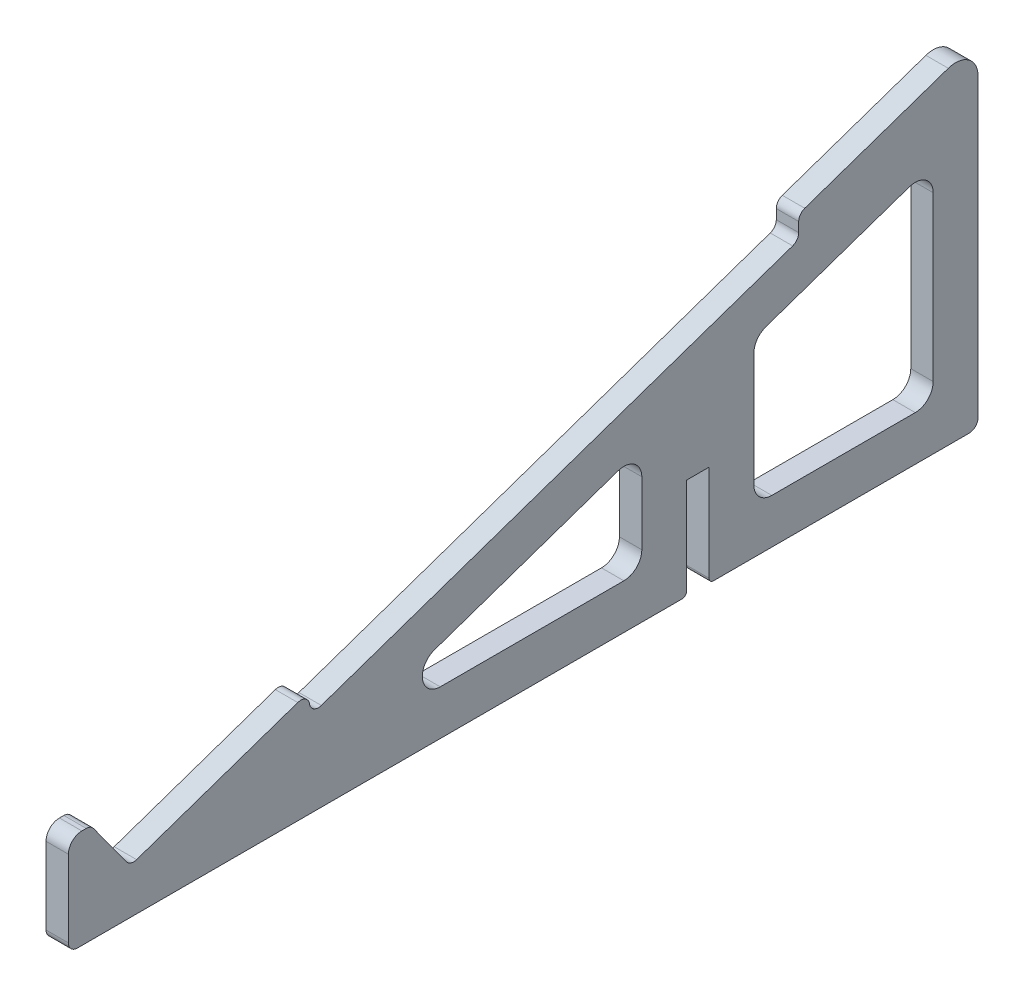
from build123d import *

# Parameters (mm, degrees)
MAIN_BODY_DEPTH  = 6.35
LIP_CUT_DEPTH    = 161.44900373
FILLET1_R        = 2.54
FILLET2_R        = 2.54
FILLET3_R        = 3.81
FILLET4_R        = 6.35
SKETCH3_W        = 6.35
SKETCH3_H        = 28.516547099
NOTCH_CUT_DEPTH  = 159.944751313
WEIGHT_CUT_DEPTH = 159.944751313
FILLET5_R        = 5.08
FILLET6_R        = 1.27


with BuildPart() as part:
    # Sketch1 → Main Body (new body)
    with BuildSketch(Plane(origin=(0, 0, 0), x_dir=(0, 0, -1), z_dir=(1, 0, 0))):
        Polygon((-128.854513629, 0), (128.854513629, 0), (128.854513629, 95.394311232), (-111.307204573, 12.7), (-122.504513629, 28.111773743), (-128.854513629, 28.111773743), align=None)
    extrude(amount=MAIN_BODY_DEPTH)

    # Sketch2 → Lip Cut (cut, through all)
    with BuildSketch(Plane(origin=(6.35, 0, 0), x_dir=(0, 0, -1), z_dir=(1, 0, 0))):
        Polygon((78.054513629, 77.902468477), (78.054513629, 71.552468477), (-60.507204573, 23.841842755), (-60.507204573, 30.191842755), align=None)
    extrude(amount=-LIP_CUT_DEPTH, mode=Mode.SUBTRACT)

    # Fillet1
    fillet1_edges = [part.edges().sort_by_distance(p)[0] for p in [
        (3.175, 30.191842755, 60.507204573),
        (3.175, 77.902468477, -78.054513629),
    ]]
    fillet(fillet1_edges, radius=FILLET1_R)

    # Fillet2
    fillet2_edges = [part.edges().sort_by_distance(p)[0] for p in [
        (3.175, 12.7, 111.307204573),
        (3.175, 71.552468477, -78.054513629),
        (3.175, 23.841842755, 60.507204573),
        (3.175, 28.111773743, 122.504513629),
        (3.175, 0, -128.854513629),
        (3.175, 0, 128.854513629),
    ]]
    fillet(fillet2_edges, radius=FILLET2_R)

    # Fillet3
    fillet3_edges = [part.edges().sort_by_distance(p)[0] for p in [
        (3.175, 28.111773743, 128.854513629),
    ]]
    fillet(fillet3_edges, radius=FILLET3_R)

    # Fillet4
    fillet4_edges = [part.edges().sort_by_distance(p)[0] for p in [
        (3.175, 95.394311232, -128.854513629),
    ]]
    fillet(fillet4_edges, radius=FILLET4_R)

    # Sketch3 → Notch Cut (cut, through all)
    with BuildSketch(Plane(origin=(6.35, 0, 0), x_dir=(0, 0, -1), z_dir=(1, 0, 0))):
        with Locations((49.479513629, 14.25827355)):
            Rectangle(SKETCH3_W, SKETCH3_H)
    extrude(amount=-NOTCH_CUT_DEPTH, mode=Mode.SUBTRACT)

    # Sketch4 → Weight Cut (cut, through all)
    with BuildSketch(Plane(origin=(6.35, 0, 0), x_dir=(0, 0, -1), z_dir=(1, 0, 0))):
        Polygon((65.354513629, 12.7), (116.154513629, 12.7), (116.154513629, 71.239567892), (65.354513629, 53.747725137), align=None)
        Polygon((33.604513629, 12.7), (33.604513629, 42.815323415), (-53.856736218, 12.7), align=None)
    extrude(amount=-WEIGHT_CUT_DEPTH, mode=Mode.SUBTRACT)

    # Fillet5
    fillet5_edges = [part.edges().sort_by_distance(p)[0] for p in [
        (3.175, 12.7, -65.354513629),
        (3.175, 53.747725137, -65.354513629),
        (3.175, 71.239567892, -116.154513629),
        (3.175, 12.7, -116.154513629),
        (3.175, 12.7, -33.604513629),
        (3.175, 12.7, 53.856736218),
        (3.175, 42.815323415, -33.604513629),
    ]]
    fillet(fillet5_edges, radius=FILLET5_R)

    # Fillet6
    fillet6_edges = [part.edges().sort_by_distance(p)[0] for p in [
        (3.175, 0, -52.654513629),
        (3.175, 0, -46.304513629),
    ]]
    fillet(fillet6_edges, radius=FILLET6_R)


solid = part.part
